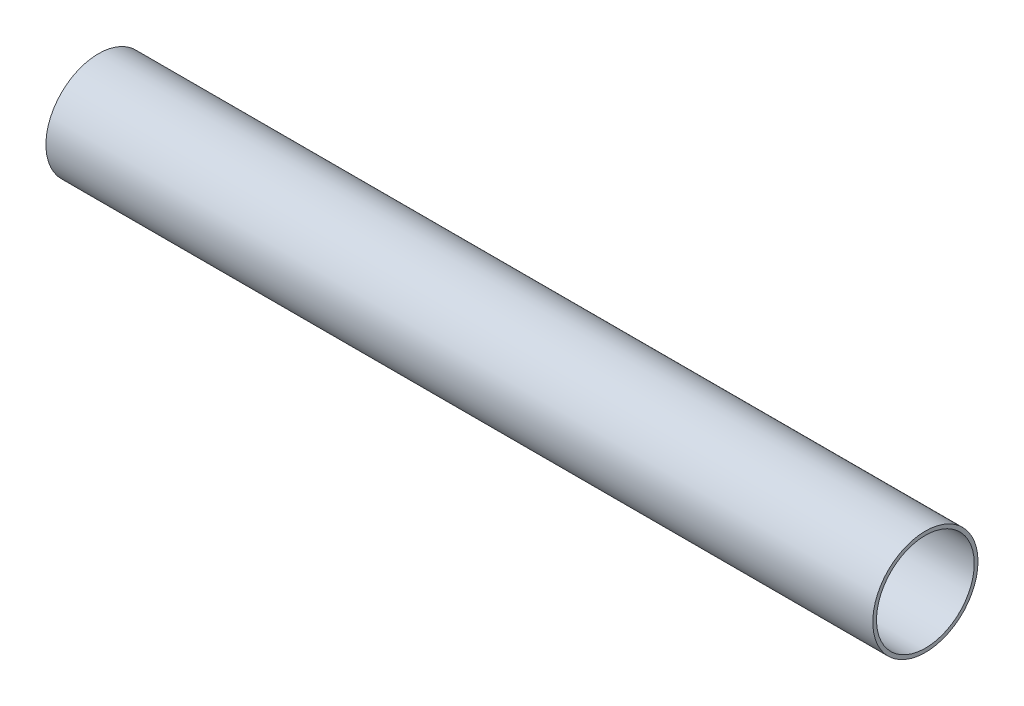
from build123d import *

# Parameters (mm, degrees)
ESQUISSE1_W = 165
ESQUISSE1_H = 0.75


with BuildPart() as part:
    # Esquisse1 → Base-R_volution (revolve)
    with BuildSketch(Plane.XY, mode=Mode.PRIVATE) as base_r_volution_sk:
        with Locations((62.5, 10.125)):
            Rectangle(ESQUISSE1_W, ESQUISSE1_H)
    revolve(base_r_volution_sk.sketch.rotate(Axis((40, 0, 0), (-1, 0, 0)), 90), axis=Axis((40, 0, 0), (-1, 0, 0)))


solid = part.part
